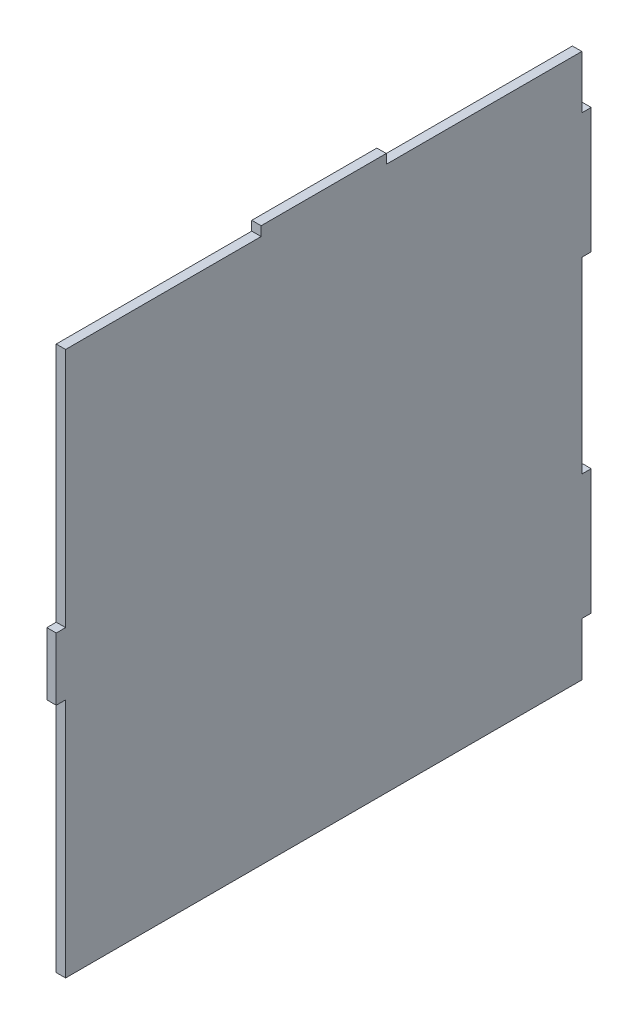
ISO-10303-21;
HEADER;
FILE_DESCRIPTION(('STEP AP214'),'2;1');
FILE_NAME('part.step','',(''),(''),'','','');
FILE_SCHEMA(('AUTOMOTIVE_DESIGN { 1 0 10303 214 1 1 1 1 }'));
ENDSEC;
DATA;
#1=APPLICATION_CONTEXT('core data for automotive mechanical design processes');
#2=APPLICATION_PROTOCOL_DEFINITION('international standard','automotive_design',2000,#1);
#3=PRODUCT_CONTEXT('',#1,'mechanical');
#4=PRODUCT('Part','Part','',(#3));
#5=PRODUCT_RELATED_PRODUCT_CATEGORY('part','',(#4));
#6=PRODUCT_DEFINITION_FORMATION('','',#4);
#7=PRODUCT_DEFINITION_CONTEXT('part definition',#1,'design');
#8=PRODUCT_DEFINITION('design','',#6,#7);
#9=PRODUCT_DEFINITION_SHAPE('','',#8);
#10=(LENGTH_UNIT() NAMED_UNIT(*) SI_UNIT(.MILLI.,.METRE.));
#11=(NAMED_UNIT(*) PLANE_ANGLE_UNIT() SI_UNIT($,.RADIAN.));
#12=(NAMED_UNIT(*) SI_UNIT($,.STERADIAN.) SOLID_ANGLE_UNIT());
#13=UNCERTAINTY_MEASURE_WITH_UNIT(LENGTH_MEASURE(1.E-05),#10,'distance_accuracy_value','');
#14=(GEOMETRIC_REPRESENTATION_CONTEXT(3) GLOBAL_UNCERTAINTY_ASSIGNED_CONTEXT((#13)) GLOBAL_UNIT_ASSIGNED_CONTEXT((#10,
#11,#12)) REPRESENTATION_CONTEXT('',''));
#15=CARTESIAN_POINT('',(0.,0.,0.));
#16=DIRECTION('',(0.,0.,1.));
#17=DIRECTION('',(1.,0.,0.));
#18=AXIS2_PLACEMENT_3D('',#15,#16,#17);
#19=CARTESIAN_POINT('',(-1777.29843742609,0.,205.));
#20=DIRECTION('',(0.,0.,-1.));
#21=DIRECTION('',(-1.,0.,0.));
#22=AXIS2_PLACEMENT_3D('',#19,#20,#21);
#23=PLANE('',#22);
#24=DIRECTION('',(0.,-1.,0.));
#25=VECTOR('',#24,1.);
#26=CARTESIAN_POINT('',(-1317.4158437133,0.,205.));
#27=LINE('',#26,#25);
#28=CARTESIAN_POINT('',(-1317.4158437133,420.510974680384,205.));
#29=VERTEX_POINT('',#28);
#30=CARTESIAN_POINT('',(-1317.4158437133,414.510974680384,205.));
#31=VERTEX_POINT('',#30);
#32=EDGE_CURVE('E53',#29,#31,#27,.T.);
#33=ORIENTED_EDGE('',*,*,#32,.T.);
#34=DIRECTION('',(1.,0.,0.));
#35=VECTOR('',#34,1.);
#36=CARTESIAN_POINT('',(-1777.29843742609,414.510974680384,205.));
#37=LINE('',#36,#35);
#38=CARTESIAN_POINT('',(-1311.4158437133,414.510974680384,205.));
#39=VERTEX_POINT('',#38);
#40=EDGE_CURVE('E68',#31,#39,#37,.T.);
#41=ORIENTED_EDGE('',*,*,#40,.T.);
#42=DIRECTION('',(0.,1.,0.));
#43=VECTOR('',#42,1.);
#44=CARTESIAN_POINT('',(-1311.4158437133,0.,205.));
#45=LINE('',#44,#43);
#46=CARTESIAN_POINT('',(-1311.4158437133,420.510974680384,205.));
#47=VERTEX_POINT('',#46);
#48=EDGE_CURVE('E365',#39,#47,#45,.T.);
#49=ORIENTED_EDGE('',*,*,#48,.T.);
#50=DIRECTION('',(1.,0.,0.));
#51=VECTOR('',#50,1.);
#52=CARTESIAN_POINT('',(-1777.29843742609,420.510974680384,205.));
#53=LINE('',#52,#51);
#54=EDGE_CURVE('E356',#29,#47,#53,.T.);
#55=ORIENTED_EDGE('',*,*,#54,.F.);
#56=EDGE_LOOP('',(#33,#41,#49,#55));
#57=FACE_BOUND('',#56,.T.);
#58=ADVANCED_FACE('F44',(#57),#23,.F.);
#59=CARTESIAN_POINT('',(-1777.29843742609,420.510974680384,0.));
#60=DIRECTION('',(0.,-1.,0.));
#61=DIRECTION('',(0.,0.,-1.));
#62=AXIS2_PLACEMENT_3D('',#59,#60,#61);
#63=PLANE('',#62);
#64=DIRECTION('',(1.,0.,0.));
#65=VECTOR('',#64,1.);
#66=CARTESIAN_POINT('',(-1777.29843742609,420.510974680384,125.));
#67=LINE('',#66,#65);
#68=CARTESIAN_POINT('',(-1317.4158437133,420.510974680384,125.));
#69=VERTEX_POINT('',#68);
#70=CARTESIAN_POINT('',(-1311.4158437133,420.510974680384,125.));
#71=VERTEX_POINT('',#70);
#72=EDGE_CURVE('E368',#69,#71,#67,.T.);
#73=ORIENTED_EDGE('',*,*,#72,.F.);
#74=DIRECTION('',(0.,0.,1.));
#75=VECTOR('',#74,1.);
#76=CARTESIAN_POINT('',(-1317.4158437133,420.510974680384,0.));
#77=LINE('',#76,#75);
#78=EDGE_CURVE('E352',#69,#29,#77,.T.);
#79=ORIENTED_EDGE('',*,*,#78,.T.);
#80=ORIENTED_EDGE('',*,*,#54,.T.);
#81=DIRECTION('',(0.,0.,-1.));
#82=VECTOR('',#81,1.);
#83=CARTESIAN_POINT('',(-1311.4158437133,420.510974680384,0.));
#84=LINE('',#83,#82);
#85=EDGE_CURVE('E361',#47,#71,#84,.T.);
#86=ORIENTED_EDGE('',*,*,#85,.T.);
#87=EDGE_LOOP('',(#73,#79,#80,#86));
#88=FACE_BOUND('',#87,.T.);
#89=ADVANCED_FACE('F376',(#88),#63,.F.);
#90=CARTESIAN_POINT('',(-1777.29843742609,0.,125.));
#91=DIRECTION('',(0.,0.,-1.));
#92=DIRECTION('',(-1.,0.,0.));
#93=AXIS2_PLACEMENT_3D('',#90,#91,#92);
#94=PLANE('',#93);
#95=DIRECTION('',(1.,0.,0.));
#96=VECTOR('',#95,1.);
#97=CARTESIAN_POINT('',(-1777.29843742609,414.510974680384,125.));
#98=LINE('',#97,#96);
#99=CARTESIAN_POINT('',(-1317.4158437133,414.510974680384,125.));
#100=VERTEX_POINT('',#99);
#101=CARTESIAN_POINT('',(-1311.4158437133,414.510974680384,125.));
#102=VERTEX_POINT('',#101);
#103=EDGE_CURVE('E347',#100,#102,#98,.T.);
#104=ORIENTED_EDGE('',*,*,#103,.F.);
#105=DIRECTION('',(0.,-1.,0.));
#106=VECTOR('',#105,1.);
#107=CARTESIAN_POINT('',(-1317.4158437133,0.,125.));
#108=LINE('',#107,#106);
#109=EDGE_CURVE('E11',#69,#100,#108,.T.);
#110=ORIENTED_EDGE('',*,*,#109,.F.);
#111=ORIENTED_EDGE('',*,*,#72,.T.);
#112=DIRECTION('',(0.,1.,0.));
#113=VECTOR('',#112,1.);
#114=CARTESIAN_POINT('',(-1311.4158437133,0.,125.));
#115=LINE('',#114,#113);
#116=EDGE_CURVE('E60',#102,#71,#115,.T.);
#117=ORIENTED_EDGE('',*,*,#116,.F.);
#118=EDGE_LOOP('',(#104,#110,#111,#117));
#119=FACE_BOUND('',#118,.T.);
#120=ADVANCED_FACE('F46',(#119),#94,.T.);
#121=CARTESIAN_POINT('',(-1311.4158437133,0.,0.));
#122=DIRECTION('',(1.,0.,0.));
#123=DIRECTION('',(0.,0.,-1.));
#124=AXIS2_PLACEMENT_3D('',#121,#122,#123);
#125=PLANE('',#124);
#126=ORIENTED_EDGE('',*,*,#48,.F.);
#127=DIRECTION('',(0.,0.,-1.));
#128=VECTOR('',#127,1.);
#129=CARTESIAN_POINT('',(-1311.4158437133,414.510974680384,330.));
#130=LINE('',#129,#128);
#131=CARTESIAN_POINT('',(-1311.4158437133,414.510974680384,330.));
#132=VERTEX_POINT('',#131);
#133=EDGE_CURVE('E339',#132,#39,#130,.T.);
#134=ORIENTED_EDGE('',*,*,#133,.F.);
#135=DIRECTION('',(0.,-1.,0.));
#136=VECTOR('',#135,1.);
#137=CARTESIAN_POINT('',(-1311.4158437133,0.,330.));
#138=LINE('',#137,#136);
#139=CARTESIAN_POINT('',(-1311.4158437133,260.510974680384,330.));
#140=VERTEX_POINT('',#139);
#141=EDGE_CURVE('E316',#132,#140,#138,.T.);
#142=ORIENTED_EDGE('',*,*,#141,.T.);
#143=DIRECTION('',(0.,0.,-1.));
#144=VECTOR('',#143,1.);
#145=CARTESIAN_POINT('',(-1311.4158437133,260.510974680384,0.));
#146=LINE('',#145,#144);
#147=CARTESIAN_POINT('',(-1311.4158437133,260.510974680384,336.));
#148=VERTEX_POINT('',#147);
#149=EDGE_CURVE('E271',#148,#140,#146,.T.);
#150=ORIENTED_EDGE('',*,*,#149,.F.);
#151=DIRECTION('',(0.,1.,0.));
#152=VECTOR('',#151,1.);
#153=CARTESIAN_POINT('',(-1311.4158437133,0.,336.));
#154=LINE('',#153,#152);
#155=CARTESIAN_POINT('',(-1311.4158437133,220.510974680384,336.));
#156=VERTEX_POINT('',#155);
#157=EDGE_CURVE('E275',#156,#148,#154,.T.);
#158=ORIENTED_EDGE('',*,*,#157,.F.);
#159=DIRECTION('',(0.,0.,-1.));
#160=VECTOR('',#159,1.);
#161=CARTESIAN_POINT('',(-1311.4158437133,220.510974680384,0.));
#162=LINE('',#161,#160);
#163=CARTESIAN_POINT('',(-1311.4158437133,220.510974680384,330.));
#164=VERTEX_POINT('',#163);
#165=EDGE_CURVE('E191',#156,#164,#162,.T.);
#166=ORIENTED_EDGE('',*,*,#165,.T.);
#167=DIRECTION('',(0.,-1.,0.));
#168=VECTOR('',#167,1.);
#169=CARTESIAN_POINT('',(-1311.4158437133,0.,330.));
#170=LINE('',#169,#168);
#171=CARTESIAN_POINT('',(-1311.4158437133,66.5109746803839,330.));
#172=VERTEX_POINT('',#171);
#173=EDGE_CURVE('E183',#164,#172,#170,.T.);
#174=ORIENTED_EDGE('',*,*,#173,.T.);
#175=DIRECTION('',(0.,0.,-1.));
#176=VECTOR('',#175,1.);
#177=CARTESIAN_POINT('',(-1311.4158437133,66.510974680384,0.));
#178=LINE('',#177,#176);
#179=CARTESIAN_POINT('',(-1311.4158437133,66.510974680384,0.));
#180=VERTEX_POINT('',#179);
#181=EDGE_CURVE('E188',#172,#180,#178,.T.);
#182=ORIENTED_EDGE('',*,*,#181,.T.);
#183=DIRECTION('',(0.,-1.,0.));
#184=VECTOR('',#183,1.);
#185=CARTESIAN_POINT('',(-1311.4158437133,0.,0.));
#186=LINE('',#185,#184);
#187=CARTESIAN_POINT('',(-1311.4158437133,100.510974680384,0.));
#188=VERTEX_POINT('',#187);
#189=EDGE_CURVE('E213',#188,#180,#186,.T.);
#190=ORIENTED_EDGE('',*,*,#189,.F.);
#191=DIRECTION('',(0.,0.,-1.));
#192=VECTOR('',#191,1.);
#193=CARTESIAN_POINT('',(-1311.4158437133,100.510974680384,0.));
#194=LINE('',#193,#192);
#195=CARTESIAN_POINT('',(-1311.4158437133,100.510974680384,-6.));
#196=VERTEX_POINT('',#195);
#197=EDGE_CURVE('E216',#188,#196,#194,.T.);
#198=ORIENTED_EDGE('',*,*,#197,.T.);
#199=DIRECTION('',(0.,-1.,0.));
#200=VECTOR('',#199,1.);
#201=CARTESIAN_POINT('',(-1311.4158437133,0.,-6.00000000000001));
#202=LINE('',#201,#200);
#203=CARTESIAN_POINT('',(-1311.4158437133,180.510974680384,-5.99999999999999));
#204=VERTEX_POINT('',#203);
#205=EDGE_CURVE('E225',#204,#196,#202,.T.);
#206=ORIENTED_EDGE('',*,*,#205,.F.);
#207=DIRECTION('',(0.,0.,-1.));
#208=VECTOR('',#207,1.);
#209=CARTESIAN_POINT('',(-1311.4158437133,180.510974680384,0.));
#210=LINE('',#209,#208);
#211=CARTESIAN_POINT('',(-1311.4158437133,180.510974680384,0.));
#212=VERTEX_POINT('',#211);
#213=EDGE_CURVE('E229',#212,#204,#210,.T.);
#214=ORIENTED_EDGE('',*,*,#213,.F.);
#215=DIRECTION('',(0.,-1.,0.));
#216=VECTOR('',#215,1.);
#217=CARTESIAN_POINT('',(-1311.4158437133,0.,0.));
#218=LINE('',#217,#216);
#219=CARTESIAN_POINT('',(-1311.4158437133,300.510974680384,0.));
#220=VERTEX_POINT('',#219);
#221=EDGE_CURVE('E307',#220,#212,#218,.T.);
#222=ORIENTED_EDGE('',*,*,#221,.F.);
#223=DIRECTION('',(0.,0.,-1.));
#224=VECTOR('',#223,1.);
#225=CARTESIAN_POINT('',(-1311.4158437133,300.510974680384,0.));
#226=LINE('',#225,#224);
#227=CARTESIAN_POINT('',(-1311.4158437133,300.510974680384,-6.));
#228=VERTEX_POINT('',#227);
#229=EDGE_CURVE('E233',#220,#228,#226,.T.);
#230=ORIENTED_EDGE('',*,*,#229,.T.);
#231=DIRECTION('',(0.,-1.,0.));
#232=VECTOR('',#231,1.);
#233=CARTESIAN_POINT('',(-1311.4158437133,0.,-6.00000000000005));
#234=LINE('',#233,#232);
#235=CARTESIAN_POINT('',(-1311.4158437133,380.510974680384,-5.99999999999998));
#236=VERTEX_POINT('',#235);
#237=EDGE_CURVE('E237',#236,#228,#234,.T.);
#238=ORIENTED_EDGE('',*,*,#237,.F.);
#239=DIRECTION('',(0.,0.,-1.));
#240=VECTOR('',#239,1.);
#241=CARTESIAN_POINT('',(-1311.4158437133,380.510974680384,0.));
#242=LINE('',#241,#240);
#243=CARTESIAN_POINT('',(-1311.4158437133,380.510974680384,0.));
#244=VERTEX_POINT('',#243);
#245=EDGE_CURVE('E207',#244,#236,#242,.T.);
#246=ORIENTED_EDGE('',*,*,#245,.F.);
#247=DIRECTION('',(0.,-1.,0.));
#248=VECTOR('',#247,1.);
#249=CARTESIAN_POINT('',(-1311.4158437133,0.,0.));
#250=LINE('',#249,#248);
#251=CARTESIAN_POINT('',(-1311.4158437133,414.510974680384,0.));
#252=VERTEX_POINT('',#251);
#253=EDGE_CURVE('E328',#252,#244,#250,.T.);
#254=ORIENTED_EDGE('',*,*,#253,.F.);
#255=EDGE_CURVE('E338',#102,#252,#130,.T.);
#256=ORIENTED_EDGE('',*,*,#255,.F.);
#257=ORIENTED_EDGE('',*,*,#116,.T.);
#258=ORIENTED_EDGE('',*,*,#85,.F.);
#259=EDGE_LOOP('',(#126,#134,#142,#150,#158,#166,#174,#182,#190,#198,#206,#214,#222,#230,#238,
#246,#254,#256,#257,#258));
#260=FACE_BOUND('',#259,.T.);
#261=ADVANCED_FACE('F185',(#260),#125,.T.);
#262=CARTESIAN_POINT('',(-1317.4158437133,0.,330.));
#263=DIRECTION('',(1.,0.,0.));
#264=DIRECTION('',(0.,0.,-1.));
#265=AXIS2_PLACEMENT_3D('',#262,#263,#264);
#266=PLANE('',#265);
#267=ORIENTED_EDGE('',*,*,#109,.T.);
#268=DIRECTION('',(0.,0.,-1.));
#269=VECTOR('',#268,1.);
#270=CARTESIAN_POINT('',(-1317.4158437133,414.510974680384,330.));
#271=LINE('',#270,#269);
#272=CARTESIAN_POINT('',(-1317.4158437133,414.510974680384,0.));
#273=VERTEX_POINT('',#272);
#274=EDGE_CURVE('E324',#100,#273,#271,.T.);
#275=ORIENTED_EDGE('',*,*,#274,.T.);
#276=DIRECTION('',(0.,-1.,0.));
#277=VECTOR('',#276,1.);
#278=CARTESIAN_POINT('',(-1317.4158437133,0.,0.));
#279=LINE('',#278,#277);
#280=CARTESIAN_POINT('',(-1317.4158437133,380.510974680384,0.));
#281=VERTEX_POINT('',#280);
#282=EDGE_CURVE('E195',#273,#281,#279,.T.);
#283=ORIENTED_EDGE('',*,*,#282,.T.);
#284=DIRECTION('',(0.,0.,1.));
#285=VECTOR('',#284,1.);
#286=CARTESIAN_POINT('',(-1317.4158437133,380.510974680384,0.));
#287=LINE('',#286,#285);
#288=CARTESIAN_POINT('',(-1317.4158437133,380.510974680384,-5.99999999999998));
#289=VERTEX_POINT('',#288);
#290=EDGE_CURVE('E219',#289,#281,#287,.T.);
#291=ORIENTED_EDGE('',*,*,#290,.F.);
#292=DIRECTION('',(0.,1.,0.));
#293=VECTOR('',#292,1.);
#294=CARTESIAN_POINT('',(-1317.4158437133,0.,-6.00000000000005));
#295=LINE('',#294,#293);
#296=CARTESIAN_POINT('',(-1317.4158437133,300.510974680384,-6.));
#297=VERTEX_POINT('',#296);
#298=EDGE_CURVE('E388',#297,#289,#295,.T.);
#299=ORIENTED_EDGE('',*,*,#298,.F.);
#300=DIRECTION('',(0.,0.,1.));
#301=VECTOR('',#300,1.);
#302=CARTESIAN_POINT('',(-1317.4158437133,300.510974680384,0.));
#303=LINE('',#302,#301);
#304=CARTESIAN_POINT('',(-1317.4158437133,300.510974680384,0.));
#305=VERTEX_POINT('',#304);
#306=EDGE_CURVE('E391',#297,#305,#303,.T.);
#307=ORIENTED_EDGE('',*,*,#306,.T.);
#308=DIRECTION('',(0.,-1.,0.));
#309=VECTOR('',#308,1.);
#310=CARTESIAN_POINT('',(-1317.4158437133,0.,0.));
#311=LINE('',#310,#309);
#312=CARTESIAN_POINT('',(-1317.4158437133,180.510974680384,0.));
#313=VERTEX_POINT('',#312);
#314=EDGE_CURVE('E270',#305,#313,#311,.T.);
#315=ORIENTED_EDGE('',*,*,#314,.T.);
#316=DIRECTION('',(0.,0.,1.));
#317=VECTOR('',#316,1.);
#318=CARTESIAN_POINT('',(-1317.4158437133,180.510974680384,0.));
#319=LINE('',#318,#317);
#320=CARTESIAN_POINT('',(-1317.4158437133,180.510974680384,-5.99999999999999));
#321=VERTEX_POINT('',#320);
#322=EDGE_CURVE('E393',#321,#313,#319,.T.);
#323=ORIENTED_EDGE('',*,*,#322,.F.);
#324=DIRECTION('',(0.,1.,0.));
#325=VECTOR('',#324,1.);
#326=CARTESIAN_POINT('',(-1317.4158437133,0.,-6.00000000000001));
#327=LINE('',#326,#325);
#328=CARTESIAN_POINT('',(-1317.4158437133,100.510974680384,-6.));
#329=VERTEX_POINT('',#328);
#330=EDGE_CURVE('E397',#329,#321,#327,.T.);
#331=ORIENTED_EDGE('',*,*,#330,.F.);
#332=DIRECTION('',(0.,0.,1.));
#333=VECTOR('',#332,1.);
#334=CARTESIAN_POINT('',(-1317.4158437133,100.510974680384,0.));
#335=LINE('',#334,#333);
#336=CARTESIAN_POINT('',(-1317.4158437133,100.510974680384,0.));
#337=VERTEX_POINT('',#336);
#338=EDGE_CURVE('E401',#329,#337,#335,.T.);
#339=ORIENTED_EDGE('',*,*,#338,.T.);
#340=DIRECTION('',(0.,1.,0.));
#341=VECTOR('',#340,1.);
#342=CARTESIAN_POINT('',(-1317.4158437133,0.,0.));
#343=LINE('',#342,#341);
#344=CARTESIAN_POINT('',(-1317.4158437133,66.510974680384,0.));
#345=VERTEX_POINT('',#344);
#346=EDGE_CURVE('E404',#345,#337,#343,.T.);
#347=ORIENTED_EDGE('',*,*,#346,.F.);
#348=DIRECTION('',(0.,0.,1.));
#349=VECTOR('',#348,1.);
#350=CARTESIAN_POINT('',(-1317.4158437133,66.510974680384,0.));
#351=LINE('',#350,#349);
#352=CARTESIAN_POINT('',(-1317.4158437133,66.5109746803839,330.));
#353=VERTEX_POINT('',#352);
#354=EDGE_CURVE('E247',#345,#353,#351,.T.);
#355=ORIENTED_EDGE('',*,*,#354,.T.);
#356=DIRECTION('',(0.,-1.,0.));
#357=VECTOR('',#356,1.);
#358=CARTESIAN_POINT('',(-1317.4158437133,0.,330.));
#359=LINE('',#358,#357);
#360=CARTESIAN_POINT('',(-1317.4158437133,220.510974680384,330.));
#361=VERTEX_POINT('',#360);
#362=EDGE_CURVE('E196',#361,#353,#359,.T.);
#363=ORIENTED_EDGE('',*,*,#362,.F.);
#364=DIRECTION('',(0.,0.,1.));
#365=VECTOR('',#364,1.);
#366=CARTESIAN_POINT('',(-1317.4158437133,220.510974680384,0.));
#367=LINE('',#366,#365);
#368=CARTESIAN_POINT('',(-1317.4158437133,220.510974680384,336.));
#369=VERTEX_POINT('',#368);
#370=EDGE_CURVE('E262',#361,#369,#367,.T.);
#371=ORIENTED_EDGE('',*,*,#370,.T.);
#372=DIRECTION('',(0.,-1.,0.));
#373=VECTOR('',#372,1.);
#374=CARTESIAN_POINT('',(-1317.4158437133,0.,336.));
#375=LINE('',#374,#373);
#376=CARTESIAN_POINT('',(-1317.4158437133,260.510974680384,336.));
#377=VERTEX_POINT('',#376);
#378=EDGE_CURVE('E266',#377,#369,#375,.T.);
#379=ORIENTED_EDGE('',*,*,#378,.F.);
#380=DIRECTION('',(0.,0.,1.));
#381=VECTOR('',#380,1.);
#382=CARTESIAN_POINT('',(-1317.4158437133,260.510974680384,0.));
#383=LINE('',#382,#381);
#384=CARTESIAN_POINT('',(-1317.4158437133,260.510974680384,330.));
#385=VERTEX_POINT('',#384);
#386=EDGE_CURVE('E265',#385,#377,#383,.T.);
#387=ORIENTED_EDGE('',*,*,#386,.F.);
#388=DIRECTION('',(0.,-1.,0.));
#389=VECTOR('',#388,1.);
#390=CARTESIAN_POINT('',(-1317.4158437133,0.,330.));
#391=LINE('',#390,#389);
#392=CARTESIAN_POINT('',(-1317.4158437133,414.510974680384,330.));
#393=VERTEX_POINT('',#392);
#394=EDGE_CURVE('E313',#393,#385,#391,.T.);
#395=ORIENTED_EDGE('',*,*,#394,.F.);
#396=EDGE_CURVE('E334',#393,#31,#271,.T.);
#397=ORIENTED_EDGE('',*,*,#396,.T.);
#398=ORIENTED_EDGE('',*,*,#32,.F.);
#399=ORIENTED_EDGE('',*,*,#78,.F.);
#400=EDGE_LOOP('',(#267,#275,#283,#291,#299,#307,#315,#323,#331,#339,#347,#355,#363,#371,#379,
#387,#395,#397,#398,#399));
#401=FACE_BOUND('',#400,.T.);
#402=ADVANCED_FACE('F411',(#401),#266,.F.);
#403=CARTESIAN_POINT('',(0.,414.510974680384,330.));
#404=DIRECTION('',(0.,1.,0.));
#405=DIRECTION('',(0.,0.,1.));
#406=AXIS2_PLACEMENT_3D('',#403,#404,#405);
#407=PLANE('',#406);
#408=ORIENTED_EDGE('',*,*,#40,.F.);
#409=ORIENTED_EDGE('',*,*,#396,.F.);
#410=DIRECTION('',(1.,0.,0.));
#411=VECTOR('',#410,1.);
#412=CARTESIAN_POINT('',(0.,414.510974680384,330.));
#413=LINE('',#412,#411);
#414=EDGE_CURVE('E320',#393,#132,#413,.T.);
#415=ORIENTED_EDGE('',*,*,#414,.T.);
#416=ORIENTED_EDGE('',*,*,#133,.T.);
#417=EDGE_LOOP('',(#408,#409,#415,#416));
#418=FACE_BOUND('',#417,.T.);
#419=ADVANCED_FACE('F450',(#418),#407,.T.);
#420=CARTESIAN_POINT('',(0.,0.,0.));
#421=DIRECTION('',(0.,0.,1.));
#422=DIRECTION('',(1.,0.,0.));
#423=AXIS2_PLACEMENT_3D('',#420,#421,#422);
#424=PLANE('',#423);
#425=DIRECTION('',(1.,0.,0.));
#426=VECTOR('',#425,1.);
#427=CARTESIAN_POINT('',(0.,380.510974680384,0.));
#428=LINE('',#427,#426);
#429=EDGE_CURVE('E343',#281,#244,#428,.T.);
#430=ORIENTED_EDGE('',*,*,#429,.F.);
#431=ORIENTED_EDGE('',*,*,#282,.F.);
#432=DIRECTION('',(1.,0.,0.));
#433=VECTOR('',#432,1.);
#434=CARTESIAN_POINT('',(0.,414.510974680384,0.));
#435=LINE('',#434,#433);
#436=EDGE_CURVE('E317',#273,#252,#435,.T.);
#437=ORIENTED_EDGE('',*,*,#436,.T.);
#438=ORIENTED_EDGE('',*,*,#253,.T.);
#439=EDGE_LOOP('',(#430,#431,#437,#438));
#440=FACE_BOUND('',#439,.T.);
#441=ADVANCED_FACE('F444',(#440),#424,.F.);
#442=ORIENTED_EDGE('',*,*,#274,.F.);
#443=ORIENTED_EDGE('',*,*,#103,.T.);
#444=ORIENTED_EDGE('',*,*,#255,.T.);
#445=ORIENTED_EDGE('',*,*,#436,.F.);
#446=EDGE_LOOP('',(#442,#443,#444,#445));
#447=FACE_BOUND('',#446,.T.);
#448=ADVANCED_FACE('F446',(#447),#407,.T.);
#449=CARTESIAN_POINT('',(0.,0.,330.));
#450=DIRECTION('',(0.,0.,1.));
#451=DIRECTION('',(1.,0.,0.));
#452=AXIS2_PLACEMENT_3D('',#449,#450,#451);
#453=PLANE('',#452);
#454=DIRECTION('',(1.,0.,0.));
#455=VECTOR('',#454,1.);
#456=CARTESIAN_POINT('',(-1777.29843742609,260.510974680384,330.));
#457=LINE('',#456,#455);
#458=EDGE_CURVE('E282',#385,#140,#457,.T.);
#459=ORIENTED_EDGE('',*,*,#458,.T.);
#460=ORIENTED_EDGE('',*,*,#141,.F.);
#461=ORIENTED_EDGE('',*,*,#414,.F.);
#462=ORIENTED_EDGE('',*,*,#394,.T.);
#463=EDGE_LOOP('',(#459,#460,#461,#462));
#464=FACE_BOUND('',#463,.T.);
#465=ADVANCED_FACE('F448',(#464),#453,.T.);
#466=CARTESIAN_POINT('',(-1777.29843742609,380.510974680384,0.));
#467=DIRECTION('',(0.,-1.,0.));
#468=DIRECTION('',(0.,0.,-1.));
#469=AXIS2_PLACEMENT_3D('',#466,#467,#468);
#470=PLANE('',#469);
#471=ORIENTED_EDGE('',*,*,#290,.T.);
#472=ORIENTED_EDGE('',*,*,#429,.T.);
#473=ORIENTED_EDGE('',*,*,#245,.T.);
#474=DIRECTION('',(1.,0.,0.));
#475=VECTOR('',#474,1.);
#476=CARTESIAN_POINT('',(-1777.29843742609,380.510974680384,-5.99999999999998));
#477=LINE('',#476,#475);
#478=EDGE_CURVE('E243',#289,#236,#477,.T.);
#479=ORIENTED_EDGE('',*,*,#478,.F.);
#480=EDGE_LOOP('',(#471,#472,#473,#479));
#481=FACE_BOUND('',#480,.T.);
#482=ADVANCED_FACE('F441',(#481),#470,.F.);
#483=ORIENTED_EDGE('',*,*,#362,.T.);
#484=DIRECTION('',(1.,0.,0.));
#485=VECTOR('',#484,1.);
#486=CARTESIAN_POINT('',(-1777.29843742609,66.5109746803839,330.));
#487=LINE('',#486,#485);
#488=EDGE_CURVE('E199',#353,#172,#487,.T.);
#489=ORIENTED_EDGE('',*,*,#488,.T.);
#490=ORIENTED_EDGE('',*,*,#173,.F.);
#491=DIRECTION('',(1.,0.,0.));
#492=VECTOR('',#491,1.);
#493=CARTESIAN_POINT('',(-1777.29843742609,220.510974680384,330.));
#494=LINE('',#493,#492);
#495=EDGE_CURVE('E286',#361,#164,#494,.T.);
#496=ORIENTED_EDGE('',*,*,#495,.F.);
#497=EDGE_LOOP('',(#483,#489,#490,#496));
#498=FACE_BOUND('',#497,.T.);
#499=ADVANCED_FACE('F200',(#498),#453,.T.);
#500=CARTESIAN_POINT('',(0.,0.,0.));
#501=DIRECTION('',(0.,0.,1.));
#502=DIRECTION('',(1.,0.,0.));
#503=AXIS2_PLACEMENT_3D('',#500,#501,#502);
#504=PLANE('',#503);
#505=ORIENTED_EDGE('',*,*,#314,.F.);
#506=DIRECTION('',(1.,0.,0.));
#507=VECTOR('',#506,1.);
#508=CARTESIAN_POINT('',(0.,300.510974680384,0.));
#509=LINE('',#508,#507);
#510=EDGE_CURVE('E298',#305,#220,#509,.T.);
#511=ORIENTED_EDGE('',*,*,#510,.T.);
#512=ORIENTED_EDGE('',*,*,#221,.T.);
#513=DIRECTION('',(1.,0.,0.));
#514=VECTOR('',#513,1.);
#515=CARTESIAN_POINT('',(0.,180.510974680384,0.));
#516=LINE('',#515,#514);
#517=EDGE_CURVE('E303',#313,#212,#516,.T.);
#518=ORIENTED_EDGE('',*,*,#517,.F.);
#519=EDGE_LOOP('',(#505,#511,#512,#518));
#520=FACE_BOUND('',#519,.T.);
#521=ADVANCED_FACE('F430',(#520),#504,.F.);
#522=CARTESIAN_POINT('',(-1777.29843742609,0.,336.));
#523=DIRECTION('',(0.,0.,-1.));
#524=DIRECTION('',(-1.,0.,0.));
#525=AXIS2_PLACEMENT_3D('',#522,#523,#524);
#526=PLANE('',#525);
#527=DIRECTION('',(1.,0.,0.));
#528=VECTOR('',#527,1.);
#529=CARTESIAN_POINT('',(-1777.29843742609,260.510974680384,336.));
#530=LINE('',#529,#528);
#531=EDGE_CURVE('E281',#377,#148,#530,.T.);
#532=ORIENTED_EDGE('',*,*,#531,.F.);
#533=ORIENTED_EDGE('',*,*,#378,.T.);
#534=DIRECTION('',(1.,0.,0.));
#535=VECTOR('',#534,1.);
#536=CARTESIAN_POINT('',(-1777.29843742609,220.510974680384,336.));
#537=LINE('',#536,#535);
#538=EDGE_CURVE('E289',#369,#156,#537,.T.);
#539=ORIENTED_EDGE('',*,*,#538,.T.);
#540=ORIENTED_EDGE('',*,*,#157,.T.);
#541=EDGE_LOOP('',(#532,#533,#539,#540));
#542=FACE_BOUND('',#541,.T.);
#543=ADVANCED_FACE('F519',(#542),#526,.F.);
#544=CARTESIAN_POINT('',(-1777.29843742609,220.510974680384,0.));
#545=DIRECTION('',(0.,-1.,0.));
#546=DIRECTION('',(0.,0.,-1.));
#547=AXIS2_PLACEMENT_3D('',#544,#545,#546);
#548=PLANE('',#547);
#549=ORIENTED_EDGE('',*,*,#370,.F.);
#550=ORIENTED_EDGE('',*,*,#495,.T.);
#551=ORIENTED_EDGE('',*,*,#165,.F.);
#552=ORIENTED_EDGE('',*,*,#538,.F.);
#553=EDGE_LOOP('',(#549,#550,#551,#552));
#554=FACE_BOUND('',#553,.T.);
#555=ADVANCED_FACE('F529',(#554),#548,.T.);
#556=CARTESIAN_POINT('',(-1777.29843742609,260.510974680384,0.));
#557=DIRECTION('',(0.,-1.,0.));
#558=DIRECTION('',(0.,0.,-1.));
#559=AXIS2_PLACEMENT_3D('',#556,#557,#558);
#560=PLANE('',#559);
#561=ORIENTED_EDGE('',*,*,#458,.F.);
#562=ORIENTED_EDGE('',*,*,#386,.T.);
#563=ORIENTED_EDGE('',*,*,#531,.T.);
#564=ORIENTED_EDGE('',*,*,#149,.T.);
#565=EDGE_LOOP('',(#561,#562,#563,#564));
#566=FACE_BOUND('',#565,.T.);
#567=ADVANCED_FACE('F540',(#566),#560,.F.);
#568=CARTESIAN_POINT('',(-1777.29843742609,0.,-6.00000000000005));
#569=DIRECTION('',(0.,0.,1.));
#570=DIRECTION('',(0.,-1.,0.));
#571=AXIS2_PLACEMENT_3D('',#568,#569,#570);
#572=PLANE('',#571);
#573=DIRECTION('',(1.,0.,0.));
#574=VECTOR('',#573,1.);
#575=CARTESIAN_POINT('',(-1777.29843742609,300.510974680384,-6.));
#576=LINE('',#575,#574);
#577=EDGE_CURVE('E248',#297,#228,#576,.T.);
#578=ORIENTED_EDGE('',*,*,#577,.F.);
#579=ORIENTED_EDGE('',*,*,#298,.T.);
#580=ORIENTED_EDGE('',*,*,#478,.T.);
#581=ORIENTED_EDGE('',*,*,#237,.T.);
#582=EDGE_LOOP('',(#578,#579,#580,#581));
#583=FACE_BOUND('',#582,.T.);
#584=ADVANCED_FACE('F438',(#583),#572,.F.);
#585=CARTESIAN_POINT('',(-1777.29843742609,300.510974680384,0.));
#586=DIRECTION('',(0.,-1.,0.));
#587=DIRECTION('',(0.,0.,-1.));
#588=AXIS2_PLACEMENT_3D('',#585,#586,#587);
#589=PLANE('',#588);
#590=ORIENTED_EDGE('',*,*,#306,.F.);
#591=ORIENTED_EDGE('',*,*,#577,.T.);
#592=ORIENTED_EDGE('',*,*,#229,.F.);
#593=ORIENTED_EDGE('',*,*,#510,.F.);
#594=EDGE_LOOP('',(#590,#591,#592,#593));
#595=FACE_BOUND('',#594,.T.);
#596=ADVANCED_FACE('F435',(#595),#589,.T.);
#597=CARTESIAN_POINT('',(-1777.29843742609,66.510974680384,0.));
#598=DIRECTION('',(0.,-1.,0.));
#599=DIRECTION('',(0.,0.,-1.));
#600=AXIS2_PLACEMENT_3D('',#597,#598,#599);
#601=PLANE('',#600);
#602=ORIENTED_EDGE('',*,*,#354,.F.);
#603=DIRECTION('',(1.,0.,0.));
#604=VECTOR('',#603,1.);
#605=CARTESIAN_POINT('',(-1777.29843742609,66.510974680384,0.));
#606=LINE('',#605,#604);
#607=EDGE_CURVE('E206',#345,#180,#606,.T.);
#608=ORIENTED_EDGE('',*,*,#607,.T.);
#609=ORIENTED_EDGE('',*,*,#181,.F.);
#610=ORIENTED_EDGE('',*,*,#488,.F.);
#611=EDGE_LOOP('',(#602,#608,#609,#610));
#612=FACE_BOUND('',#611,.T.);
#613=ADVANCED_FACE('F209',(#612),#601,.T.);
#614=CARTESIAN_POINT('',(-1777.29843742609,0.,0.));
#615=DIRECTION('',(0.,0.,1.));
#616=DIRECTION('',(1.,0.,0.));
#617=AXIS2_PLACEMENT_3D('',#614,#615,#616);
#618=PLANE('',#617);
#619=ORIENTED_EDGE('',*,*,#607,.F.);
#620=ORIENTED_EDGE('',*,*,#346,.T.);
#621=DIRECTION('',(1.,0.,0.));
#622=VECTOR('',#621,1.);
#623=CARTESIAN_POINT('',(-1777.29843742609,100.510974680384,0.));
#624=LINE('',#623,#622);
#625=EDGE_CURVE('E257',#337,#188,#624,.T.);
#626=ORIENTED_EDGE('',*,*,#625,.T.);
#627=ORIENTED_EDGE('',*,*,#189,.T.);
#628=EDGE_LOOP('',(#619,#620,#626,#627));
#629=FACE_BOUND('',#628,.T.);
#630=ADVANCED_FACE('F415',(#629),#618,.F.);
#631=CARTESIAN_POINT('',(-1777.29843742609,100.510974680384,0.));
#632=DIRECTION('',(0.,-1.,0.));
#633=DIRECTION('',(0.,0.,-1.));
#634=AXIS2_PLACEMENT_3D('',#631,#632,#633);
#635=PLANE('',#634);
#636=ORIENTED_EDGE('',*,*,#338,.F.);
#637=DIRECTION('',(1.,0.,0.));
#638=VECTOR('',#637,1.);
#639=CARTESIAN_POINT('',(-1777.29843742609,100.510974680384,-6.));
#640=LINE('',#639,#638);
#641=EDGE_CURVE('E254',#329,#196,#640,.T.);
#642=ORIENTED_EDGE('',*,*,#641,.T.);
#643=ORIENTED_EDGE('',*,*,#197,.F.);
#644=ORIENTED_EDGE('',*,*,#625,.F.);
#645=EDGE_LOOP('',(#636,#642,#643,#644));
#646=FACE_BOUND('',#645,.T.);
#647=ADVANCED_FACE('F419',(#646),#635,.T.);
#648=CARTESIAN_POINT('',(-1777.29843742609,0.,-6.00000000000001));
#649=DIRECTION('',(0.,0.,1.));
#650=DIRECTION('',(0.,-1.,0.));
#651=AXIS2_PLACEMENT_3D('',#648,#649,#650);
#652=PLANE('',#651);
#653=ORIENTED_EDGE('',*,*,#641,.F.);
#654=ORIENTED_EDGE('',*,*,#330,.T.);
#655=DIRECTION('',(1.,0.,0.));
#656=VECTOR('',#655,1.);
#657=CARTESIAN_POINT('',(-1777.29843742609,180.510974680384,-5.99999999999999));
#658=LINE('',#657,#656);
#659=EDGE_CURVE('E251',#321,#204,#658,.T.);
#660=ORIENTED_EDGE('',*,*,#659,.T.);
#661=ORIENTED_EDGE('',*,*,#205,.T.);
#662=EDGE_LOOP('',(#653,#654,#660,#661));
#663=FACE_BOUND('',#662,.T.);
#664=ADVANCED_FACE('F422',(#663),#652,.F.);
#665=CARTESIAN_POINT('',(-1777.29843742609,180.510974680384,0.));
#666=DIRECTION('',(0.,-1.,0.));
#667=DIRECTION('',(0.,0.,-1.));
#668=AXIS2_PLACEMENT_3D('',#665,#666,#667);
#669=PLANE('',#668);
#670=ORIENTED_EDGE('',*,*,#659,.F.);
#671=ORIENTED_EDGE('',*,*,#322,.T.);
#672=ORIENTED_EDGE('',*,*,#517,.T.);
#673=ORIENTED_EDGE('',*,*,#213,.T.);
#674=EDGE_LOOP('',(#670,#671,#672,#673));
#675=FACE_BOUND('',#674,.T.);
#676=ADVANCED_FACE('F427',(#675),#669,.F.);
#677=CLOSED_SHELL('',(#58,#89,#120,#261,#402,#419,#441,#448,#465,#482,#499,#521,#543,#555,#567,
#584,#596,#613,#630,#647,#664,#676));
#678=MANIFOLD_SOLID_BREP('B2',#677);
#679=ADVANCED_BREP_SHAPE_REPRESENTATION('',(#18,#678),#14);
#680=SHAPE_DEFINITION_REPRESENTATION(#9,#679);
ENDSEC;
END-ISO-10303-21;
